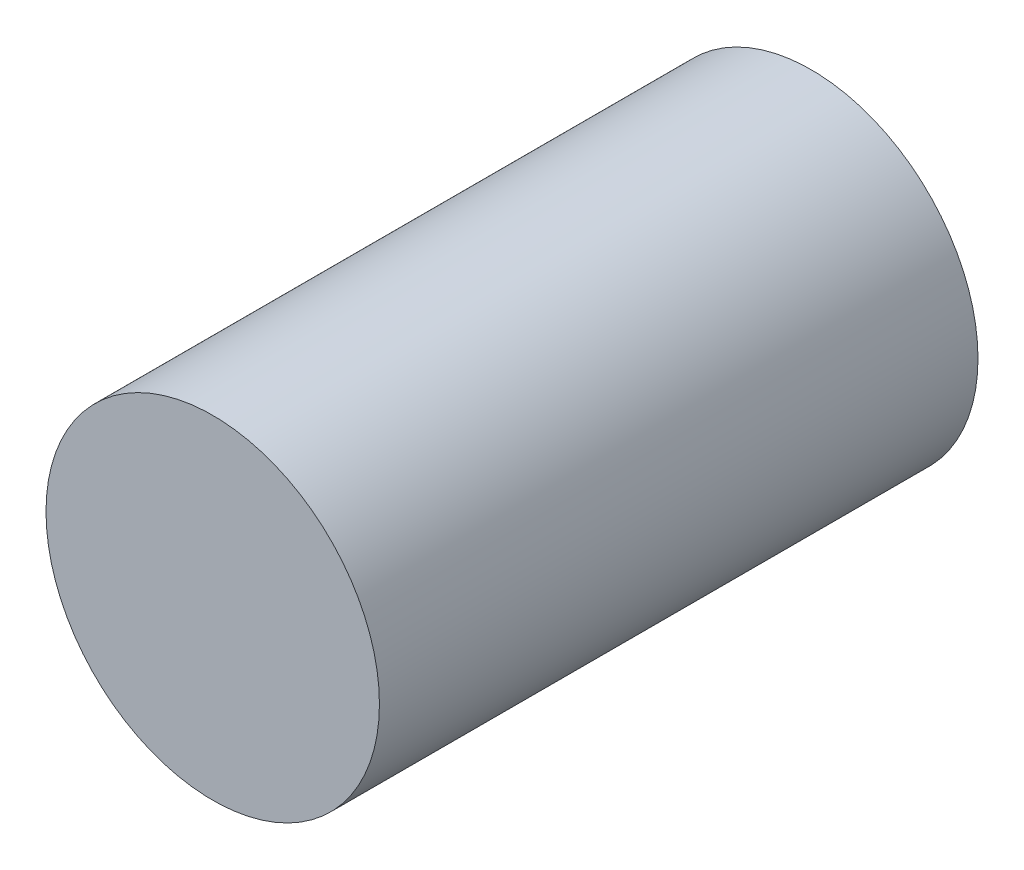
ISO-10303-21;
HEADER;
FILE_DESCRIPTION(('STEP AP214'),'2;1');
FILE_NAME('part.step','',(''),(''),'','','');
FILE_SCHEMA(('AUTOMOTIVE_DESIGN { 1 0 10303 214 1 1 1 1 }'));
ENDSEC;
DATA;
#1=APPLICATION_CONTEXT('core data for automotive mechanical design processes');
#2=APPLICATION_PROTOCOL_DEFINITION('international standard','automotive_design',2000,#1);
#3=PRODUCT_CONTEXT('',#1,'mechanical');
#4=PRODUCT('Part','Part','',(#3));
#5=PRODUCT_RELATED_PRODUCT_CATEGORY('part','',(#4));
#6=PRODUCT_DEFINITION_FORMATION('','',#4);
#7=PRODUCT_DEFINITION_CONTEXT('part definition',#1,'design');
#8=PRODUCT_DEFINITION('design','',#6,#7);
#9=PRODUCT_DEFINITION_SHAPE('','',#8);
#10=(LENGTH_UNIT() NAMED_UNIT(*) SI_UNIT(.MILLI.,.METRE.));
#11=(NAMED_UNIT(*) PLANE_ANGLE_UNIT() SI_UNIT($,.RADIAN.));
#12=(NAMED_UNIT(*) SI_UNIT($,.STERADIAN.) SOLID_ANGLE_UNIT());
#13=UNCERTAINTY_MEASURE_WITH_UNIT(LENGTH_MEASURE(1.E-05),#10,'distance_accuracy_value','');
#14=(GEOMETRIC_REPRESENTATION_CONTEXT(3) GLOBAL_UNCERTAINTY_ASSIGNED_CONTEXT((#13)) GLOBAL_UNIT_ASSIGNED_CONTEXT((#10,
#11,#12)) REPRESENTATION_CONTEXT('',''));
#15=CARTESIAN_POINT('',(0.,0.,0.));
#16=DIRECTION('',(0.,0.,1.));
#17=DIRECTION('',(1.,0.,0.));
#18=AXIS2_PLACEMENT_3D('',#15,#16,#17);
#19=CARTESIAN_POINT('',(0.,0.,18.6944));
#20=DIRECTION('',(0.,0.,-1.));
#21=DIRECTION('',(-1.,0.,0.));
#22=AXIS2_PLACEMENT_3D('',#19,#20,#21);
#23=CYLINDRICAL_SURFACE('',#22,5.207);
#24=CARTESIAN_POINT('',(0.,0.,18.6944));
#25=DIRECTION('',(0.,0.,1.));
#26=DIRECTION('',(1.,0.,0.));
#27=AXIS2_PLACEMENT_3D('',#24,#25,#26);
#28=CIRCLE('',#27,5.207);
#29=CARTESIAN_POINT('',(5.207,0.,18.6944));
#30=VERTEX_POINT('',#29);
#31=EDGE_CURVE('E10',#30,#30,#28,.T.);
#32=ORIENTED_EDGE('',*,*,#31,.F.);
#33=EDGE_LOOP('',(#32));
#34=FACE_BOUND('',#33,.T.);
#35=CARTESIAN_POINT('',(0.,0.,0.));
#36=DIRECTION('',(0.,0.,1.));
#37=DIRECTION('',(1.,0.,0.));
#38=AXIS2_PLACEMENT_3D('',#35,#36,#37);
#39=CIRCLE('',#38,5.207);
#40=CARTESIAN_POINT('',(5.207,0.,0.));
#41=VERTEX_POINT('',#40);
#42=EDGE_CURVE('E46',#41,#41,#39,.T.);
#43=ORIENTED_EDGE('',*,*,#42,.T.);
#44=EDGE_LOOP('',(#43));
#45=FACE_BOUND('',#44,.T.);
#46=ADVANCED_FACE('F43',(#34,#45),#23,.T.);
#47=CARTESIAN_POINT('',(0.,0.,18.6944));
#48=DIRECTION('',(0.,0.,1.));
#49=DIRECTION('',(1.,0.,0.));
#50=AXIS2_PLACEMENT_3D('',#47,#48,#49);
#51=PLANE('',#50);
#52=ORIENTED_EDGE('',*,*,#31,.T.);
#53=EDGE_LOOP('',(#52));
#54=FACE_BOUND('',#53,.T.);
#55=ADVANCED_FACE('F60',(#54),#51,.T.);
#56=CARTESIAN_POINT('',(0.,0.,0.));
#57=DIRECTION('',(0.,0.,1.));
#58=DIRECTION('',(1.,0.,0.));
#59=AXIS2_PLACEMENT_3D('',#56,#57,#58);
#60=PLANE('',#59);
#61=ORIENTED_EDGE('',*,*,#42,.F.);
#62=EDGE_LOOP('',(#61));
#63=FACE_BOUND('',#62,.T.);
#64=ADVANCED_FACE('F58',(#63),#60,.F.);
#65=CLOSED_SHELL('',(#46,#55,#64));
#66=MANIFOLD_SOLID_BREP('B2',#65);
#67=ADVANCED_BREP_SHAPE_REPRESENTATION('',(#18,#66),#14);
#68=SHAPE_DEFINITION_REPRESENTATION(#9,#67);
ENDSEC;
END-ISO-10303-21;
